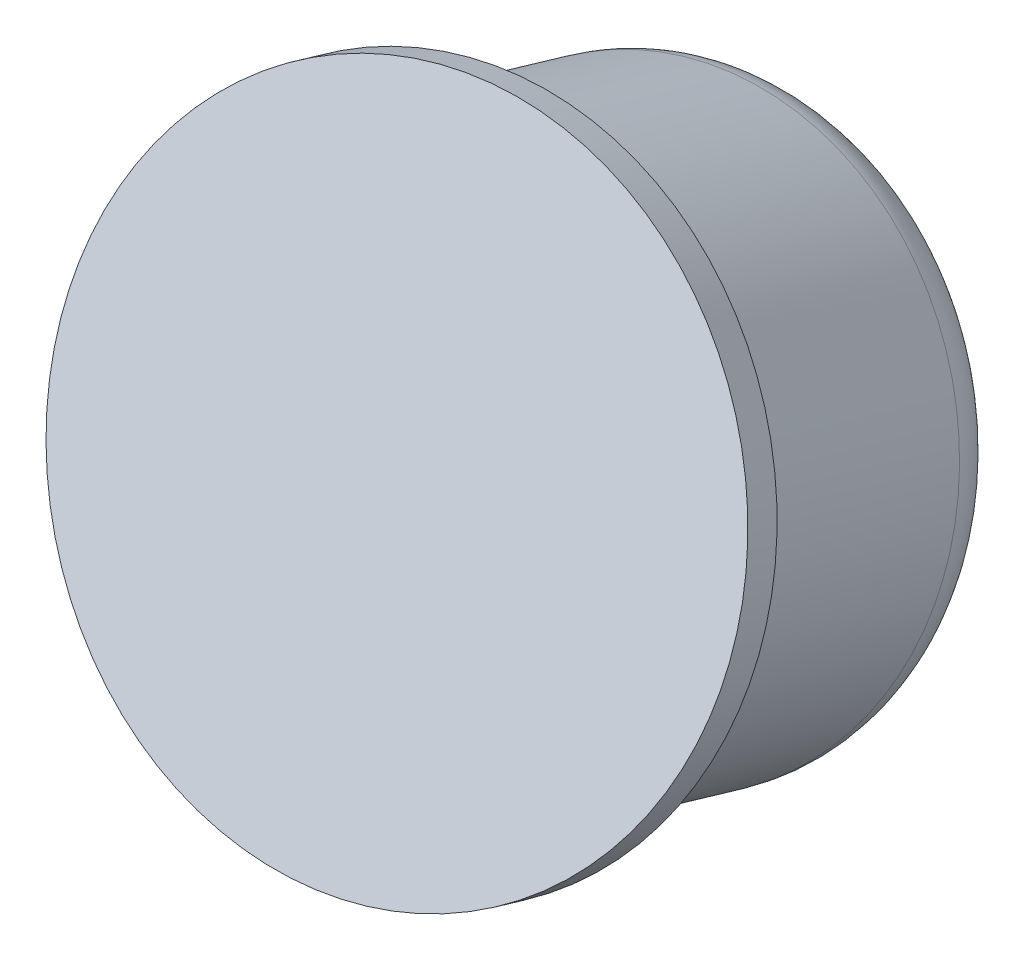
ISO-10303-21;
HEADER;
FILE_DESCRIPTION(('STEP AP214'),'2;1');
FILE_NAME('part.step','',(''),(''),'','','');
FILE_SCHEMA(('AUTOMOTIVE_DESIGN { 1 0 10303 214 1 1 1 1 }'));
ENDSEC;
DATA;
#1=APPLICATION_CONTEXT('core data for automotive mechanical design processes');
#2=APPLICATION_PROTOCOL_DEFINITION('international standard','automotive_design',2000,#1);
#3=PRODUCT_CONTEXT('',#1,'mechanical');
#4=PRODUCT('Part','Part','',(#3));
#5=PRODUCT_RELATED_PRODUCT_CATEGORY('part','',(#4));
#6=PRODUCT_DEFINITION_FORMATION('','',#4);
#7=PRODUCT_DEFINITION_CONTEXT('part definition',#1,'design');
#8=PRODUCT_DEFINITION('design','',#6,#7);
#9=PRODUCT_DEFINITION_SHAPE('','',#8);
#10=(LENGTH_UNIT() NAMED_UNIT(*) SI_UNIT(.MILLI.,.METRE.));
#11=(NAMED_UNIT(*) PLANE_ANGLE_UNIT() SI_UNIT($,.RADIAN.));
#12=(NAMED_UNIT(*) SI_UNIT($,.STERADIAN.) SOLID_ANGLE_UNIT());
#13=UNCERTAINTY_MEASURE_WITH_UNIT(LENGTH_MEASURE(1.E-05),#10,'distance_accuracy_value','');
#14=(GEOMETRIC_REPRESENTATION_CONTEXT(3) GLOBAL_UNCERTAINTY_ASSIGNED_CONTEXT((#13)) GLOBAL_UNIT_ASSIGNED_CONTEXT((#10,
#11,#12)) REPRESENTATION_CONTEXT('',''));
#15=CARTESIAN_POINT('',(0.,0.,0.));
#16=DIRECTION('',(0.,0.,1.));
#17=DIRECTION('',(1.,0.,0.));
#18=AXIS2_PLACEMENT_3D('',#15,#16,#17);
#19=CARTESIAN_POINT('',(-859.519567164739,-308.548691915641,-468.559071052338));
#20=DIRECTION('',(0.0989674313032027,0.344641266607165,0.933502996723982));
#21=DIRECTION('',(0.,-0.938108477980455,0.346341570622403));
#22=AXIS2_PLACEMENT_3D('',#19,#20,#21);
#23=PLANE('',#22);
#24=CARTESIAN_POINT('',(-859.51956716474,-308.548691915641,-468.559071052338));
#25=DIRECTION('',(0.0989674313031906,0.344641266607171,0.933502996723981));
#26=DIRECTION('',(0.,-0.938108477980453,0.346341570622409));
#27=AXIS2_PLACEMENT_3D('',#24,#25,#26);
#28=CIRCLE('',#27,28.575);
#29=CARTESIAN_POINT('',(-859.51956716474,-335.355141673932,-458.662360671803));
#30=VERTEX_POINT('',#29);
#31=EDGE_CURVE('E279',#30,#30,#28,.F.);
#32=ORIENTED_EDGE('',*,*,#31,.F.);
#33=EDGE_LOOP('',(#32));
#34=FACE_BOUND('',#33,.T.);
#35=ADVANCED_FACE('F36',(#34),#23,.T.);
#36=CARTESIAN_POINT('',(-859.841330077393,-309.669189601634,-471.594075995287));
#37=DIRECTION('',(0.0989674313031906,0.344641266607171,0.933502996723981));
#38=DIRECTION('',(0.,-0.938108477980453,0.346341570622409));
#39=AXIS2_PLACEMENT_3D('',#36,#37,#38);
#40=CYLINDRICAL_SURFACE('',#39,28.575);
#41=ORIENTED_EDGE('',*,*,#31,.T.);
#42=EDGE_LOOP('',(#41));
#43=FACE_BOUND('',#42,.T.);
#44=CARTESIAN_POINT('',(-859.841330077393,-309.669189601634,-471.594075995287));
#45=DIRECTION('',(0.0989674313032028,0.344641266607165,0.933502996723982));
#46=DIRECTION('',(0.253535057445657,0.898415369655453,-0.358566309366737));
#47=AXIS2_PLACEMENT_3D('',#44,#45,#46);
#48=CIRCLE('',#47,28.5750000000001);
#49=CARTESIAN_POINT('',(-852.596565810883,-283.996970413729,-481.840108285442));
#50=VERTEX_POINT('',#49);
#51=EDGE_CURVE('E280',#50,#50,#48,.F.);
#52=ORIENTED_EDGE('',*,*,#51,.F.);
#53=EDGE_LOOP('',(#52));
#54=FACE_BOUND('',#53,.T.);
#55=ADVANCED_FACE('F194',(#43,#54),#40,.T.);
#56=CARTESIAN_POINT('',(-859.841330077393,-309.669189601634,-471.594075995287));
#57=DIRECTION('',(0.0989674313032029,0.344641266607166,0.933502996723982));
#58=DIRECTION('',(0.,-0.938108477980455,0.346341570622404));
#59=AXIS2_PLACEMENT_3D('',#56,#57,#58);
#60=CONICAL_SURFACE('',#59,28.5750000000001,0.785398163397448);
#61=CARTESIAN_POINT('',(-859.992156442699,-310.194422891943,-473.016734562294));
#62=DIRECTION('',(0.0989674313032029,0.344641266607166,0.933502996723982));
#63=DIRECTION('',(0.,-0.938108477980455,0.346341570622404));
#64=AXIS2_PLACEMENT_3D('',#61,#62,#63);
#65=CIRCLE('',#64,27.0510000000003);
#66=CARTESIAN_POINT('',(-859.992156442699,-335.571195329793,-463.647848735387));
#67=VERTEX_POINT('',#66);
#68=EDGE_CURVE('E73',#67,#67,#65,.F.);
#69=ORIENTED_EDGE('',*,*,#68,.F.);
#70=EDGE_LOOP('',(#69));
#71=FACE_BOUND('',#70,.T.);
#72=ORIENTED_EDGE('',*,*,#51,.T.);
#73=EDGE_LOOP('',(#72));
#74=FACE_BOUND('',#73,.T.);
#75=ADVANCED_FACE('F184',(#71,#74),#60,.T.);
#76=CARTESIAN_POINT('',(-859.992156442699,-310.194422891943,-473.016734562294));
#77=DIRECTION('',(-0.0989674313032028,-0.344641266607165,-0.933502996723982));
#78=DIRECTION('',(0.,0.938108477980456,-0.346341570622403));
#79=AXIS2_PLACEMENT_3D('',#76,#77,#78);
#80=PLANE('',#79);
#81=ORIENTED_EDGE('',*,*,#68,.T.);
#82=EDGE_LOOP('',(#81));
#83=FACE_BOUND('',#82,.T.);
#84=CARTESIAN_POINT('',(-859.992156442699,-310.194422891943,-473.016734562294));
#85=DIRECTION('',(-0.0989674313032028,-0.344641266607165,-0.933502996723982));
#86=DIRECTION('',(-0.253535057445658,-0.898415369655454,0.358566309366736));
#87=AXIS2_PLACEMENT_3D('',#84,#85,#86);
#88=CIRCLE('',#87,26.2890000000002);
#89=CARTESIAN_POINT('',(-866.657339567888,-333.812864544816,-463.590384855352));
#90=VERTEX_POINT('',#89);
#91=CARTESIAN_POINT('',(-853.32697331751,-286.575981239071,-482.443084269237));
#92=VERTEX_POINT('',#91);
#93=EDGE_CURVE('E66',#90,#92,#88,.T.);
#94=ORIENTED_EDGE('',*,*,#93,.F.);
#95=CARTESIAN_POINT('',(-859.992156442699,-310.194422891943,-473.016734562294));
#96=DIRECTION('',(-0.0989674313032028,-0.344641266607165,-0.933502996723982));
#97=DIRECTION('',(0.253535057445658,0.898415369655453,-0.358566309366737));
#98=AXIS2_PLACEMENT_3D('',#95,#96,#97);
#99=CIRCLE('',#98,26.2890000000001);
#100=EDGE_CURVE('E71',#92,#90,#99,.T.);
#101=ORIENTED_EDGE('',*,*,#100,.F.);
#102=EDGE_LOOP('',(#94,#101));
#103=FACE_BOUND('',#102,.T.);
#104=ADVANCED_FACE('F70',(#83,#103),#80,.T.);
#105=CARTESIAN_POINT('',(-863.385749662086,-322.012171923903,-505.02655231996));
#106=DIRECTION('',(-0.0989674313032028,-0.344641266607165,-0.933502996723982));
#107=DIRECTION('',(0.,0.938108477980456,-0.346341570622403));
#108=AXIS2_PLACEMENT_3D('',#105,#106,#107);
#109=PLANE('',#108);
#110=CARTESIAN_POINT('',(-863.385749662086,-322.012171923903,-505.02655231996));
#111=DIRECTION('',(0.0989674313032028,0.344641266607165,0.933502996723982));
#112=DIRECTION('',(-0.253535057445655,-0.898415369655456,0.358566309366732));
#113=AXIS2_PLACEMENT_3D('',#110,#111,#112);
#114=CIRCLE('',#113,10.5659683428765);
#115=CARTESIAN_POINT('',(-866.064593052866,-331.504800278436,-501.237952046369));
#116=VERTEX_POINT('',#115);
#117=CARTESIAN_POINT('',(-860.706906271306,-312.51954356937,-508.815152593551));
#118=VERTEX_POINT('',#117);
#119=EDGE_CURVE('E78',#116,#118,#114,.T.);
#120=ORIENTED_EDGE('',*,*,#119,.F.);
#121=CARTESIAN_POINT('',(-863.385749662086,-322.012171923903,-505.02655231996));
#122=DIRECTION('',(0.0989674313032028,0.344641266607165,0.933502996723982));
#123=DIRECTION('',(0.253535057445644,0.898415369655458,-0.358566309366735));
#124=AXIS2_PLACEMENT_3D('',#121,#122,#123);
#125=CIRCLE('',#124,10.5659683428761);
#126=EDGE_CURVE('E57',#118,#116,#125,.T.);
#127=ORIENTED_EDGE('',*,*,#126,.F.);
#128=EDGE_LOOP('',(#120,#127));
#129=FACE_BOUND('',#128,.T.);
#130=ADVANCED_FACE('F99',(#129),#109,.T.);
#131=CARTESIAN_POINT('',(-860.142982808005,-310.719656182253,-474.439393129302));
#132=DIRECTION('',(0.0989674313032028,0.344641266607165,0.933502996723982));
#133=DIRECTION('',(-0.253535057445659,-0.898415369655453,0.358566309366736));
#134=AXIS2_PLACEMENT_3D('',#131,#132,#133);
#135=TOROIDAL_SURFACE('',#134,26.289,1.524);
#136=ORIENTED_EDGE('',*,*,#93,.T.);
#137=ORIENTED_EDGE('',*,*,#100,.T.);
#138=EDGE_LOOP('',(#136,#137));
#139=FACE_BOUND('',#138,.T.);
#140=CARTESIAN_POINT('',(-860.142982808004,-310.719656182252,-474.439393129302));
#141=DIRECTION('',(0.0989674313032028,0.344641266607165,0.933502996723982));
#142=DIRECTION('',(-0.253535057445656,-0.898415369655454,0.358566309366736));
#143=AXIS2_PLACEMENT_3D('',#140,#141,#142);
#144=CIRCLE('',#143,24.765);
#145=CARTESIAN_POINT('',(-866.421778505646,-332.96891281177,-465.559498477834));
#146=VERTEX_POINT('',#145);
#147=EDGE_CURVE('E86',#146,#146,#144,.F.);
#148=ORIENTED_EDGE('',*,*,#147,.F.);
#149=EDGE_LOOP('',(#148));
#150=FACE_BOUND('',#149,.T.);
#151=ADVANCED_FACE('F76',(#139,#150),#135,.F.);
#152=CARTESIAN_POINT('',(-862.75730647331,-319.823699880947,-499.098808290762));
#153=DIRECTION('',(0.0989674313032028,0.344641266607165,0.933502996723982));
#154=DIRECTION('',(-0.253535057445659,-0.898415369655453,0.358566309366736));
#155=AXIS2_PLACEMENT_3D('',#152,#153,#154);
#156=TOROIDAL_SURFACE('',#155,10.5659683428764,6.35);
#157=ORIENTED_EDGE('',*,*,#126,.T.);
#158=ORIENTED_EDGE('',*,*,#119,.T.);
#159=EDGE_LOOP('',(#157,#158));
#160=FACE_BOUND('',#159,.T.);
#161=CARTESIAN_POINT('',(-863.31940314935,-321.78112878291,-504.400743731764));
#162=DIRECTION('',(0.0989674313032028,0.344641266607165,0.933502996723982));
#163=DIRECTION('',(0.253535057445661,0.898415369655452,-0.358566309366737));
#164=AXIS2_PLACEMENT_3D('',#161,#162,#163);
#165=CIRCLE('',#164,13.4057746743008);
#166=CARTESIAN_POINT('',(-859.920569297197,-309.73717477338,-509.20760288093));
#167=VERTEX_POINT('',#166);
#168=EDGE_CURVE('E81',#167,#167,#165,.T.);
#169=ORIENTED_EDGE('',*,*,#168,.F.);
#170=EDGE_LOOP('',(#169));
#171=FACE_BOUND('',#170,.T.);
#172=ADVANCED_FACE('F98',(#160,#171),#156,.T.);
#173=CARTESIAN_POINT('',(-862.368907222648,-318.471149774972,-495.435261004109));
#174=DIRECTION('',(0.0989674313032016,0.344641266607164,0.933502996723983));
#175=DIRECTION('',(0.,-0.938108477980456,0.346341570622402));
#176=AXIS2_PLACEMENT_3D('',#173,#174,#175);
#177=CYLINDRICAL_SURFACE('',#176,24.765);
#178=CARTESIAN_POINT('',(-862.368907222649,-318.471149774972,-495.435261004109));
#179=DIRECTION('',(-0.0989674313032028,-0.344641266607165,-0.933502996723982));
#180=DIRECTION('',(0.253535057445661,0.898415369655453,-0.358566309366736));
#181=AXIS2_PLACEMENT_3D('',#178,#179,#180);
#182=CIRCLE('',#181,24.765);
#183=CARTESIAN_POINT('',(-856.090111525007,-296.221893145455,-504.315155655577));
#184=VERTEX_POINT('',#183);
#185=EDGE_CURVE('E49',#184,#184,#182,.T.);
#186=ORIENTED_EDGE('',*,*,#185,.F.);
#187=EDGE_LOOP('',(#186));
#188=FACE_BOUND('',#187,.T.);
#189=ORIENTED_EDGE('',*,*,#147,.T.);
#190=EDGE_LOOP('',(#189));
#191=FACE_BOUND('',#190,.T.);
#192=ADVANCED_FACE('F134',(#188,#191),#177,.T.);
#193=CARTESIAN_POINT('',(-862.931003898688,-320.428578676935,-500.73719644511));
#194=DIRECTION('',(0.0989674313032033,0.34464126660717,0.93350299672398));
#195=DIRECTION('',(0.,-0.938108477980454,0.346341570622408));
#196=AXIS2_PLACEMENT_3D('',#193,#194,#195);
#197=CONICAL_SURFACE('',#196,21.2548063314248,1.10714871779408);
#198=CARTESIAN_POINT('',(-862.931003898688,-320.428578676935,-500.737196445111));
#199=DIRECTION('',(-0.0989674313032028,-0.344641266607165,-0.933502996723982));
#200=DIRECTION('',(0.253535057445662,0.898415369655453,-0.358566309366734));
#201=AXIS2_PLACEMENT_3D('',#198,#199,#200);
#202=CIRCLE('',#201,21.2548063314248);
#203=CARTESIAN_POINT('',(-857.542165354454,-301.332933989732,-508.358453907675));
#204=VERTEX_POINT('',#203);
#205=EDGE_CURVE('E11',#204,#204,#202,.F.);
#206=ORIENTED_EDGE('',*,*,#205,.F.);
#207=EDGE_LOOP('',(#206));
#208=FACE_BOUND('',#207,.T.);
#209=ORIENTED_EDGE('',*,*,#168,.T.);
#210=EDGE_LOOP('',(#209));
#211=FACE_BOUND('',#210,.T.);
#212=ADVANCED_FACE('F132',(#208,#211),#197,.T.);
#213=CARTESIAN_POINT('',(-862.368907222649,-318.471149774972,-495.435261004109));
#214=DIRECTION('',(-0.0989674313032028,-0.344641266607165,-0.933502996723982));
#215=DIRECTION('',(0.25353505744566,0.898415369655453,-0.358566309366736));
#216=AXIS2_PLACEMENT_3D('',#213,#214,#215);
#217=TOROIDAL_SURFACE('',#216,18.415,6.35);
#218=ORIENTED_EDGE('',*,*,#185,.T.);
#219=EDGE_LOOP('',(#218));
#220=FACE_BOUND('',#219,.T.);
#221=ORIENTED_EDGE('',*,*,#205,.T.);
#222=EDGE_LOOP('',(#221));
#223=FACE_BOUND('',#222,.T.);
#224=ADVANCED_FACE('F38',(#220,#223),#217,.T.);
#225=CLOSED_SHELL('',(#35,#55,#75,#104,#130,#151,#172,#192,#212,#224));
#226=MANIFOLD_SOLID_BREP('B2',#225);
#227=ADVANCED_BREP_SHAPE_REPRESENTATION('',(#18,#226),#14);
#228=SHAPE_DEFINITION_REPRESENTATION(#9,#227);
ENDSEC;
END-ISO-10303-21;
